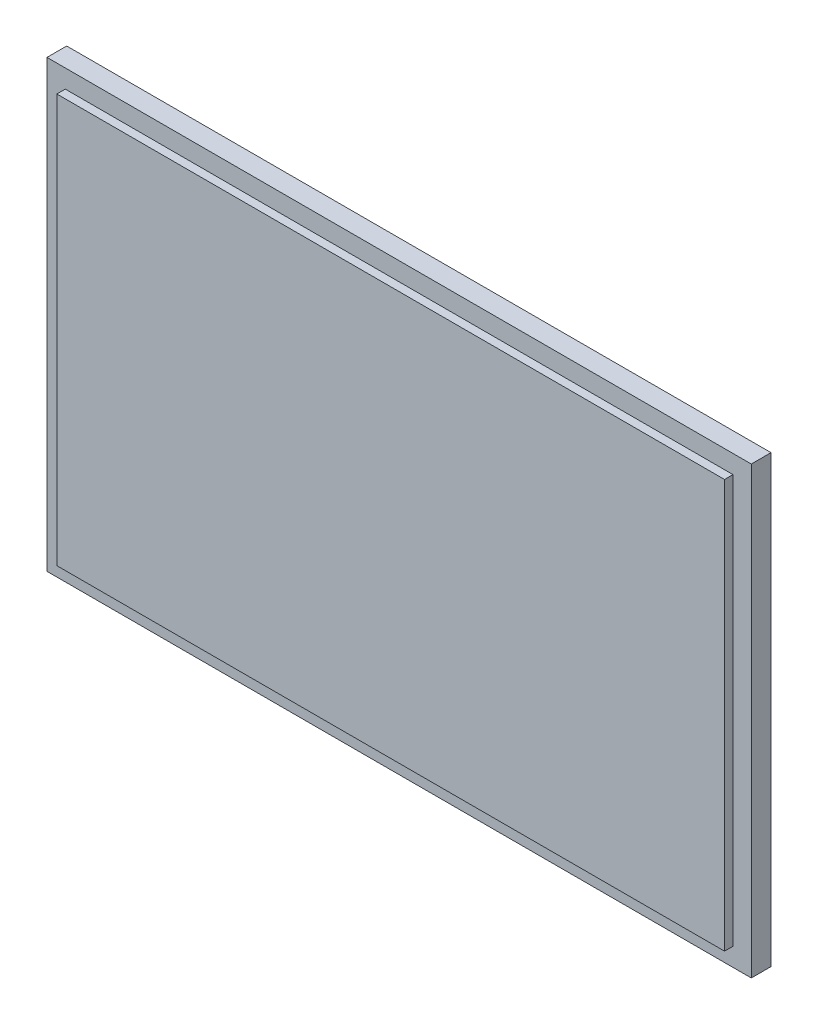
from build123d import *

# Parameters (mm, degrees)
ESQUISSE1_W             = 250
ESQUISSE1_H             = 158
BOSS_EXTRU_1_DEPTH      = 10
ESQUISSE3_W             = 250
ESQUISSE3_H             = 6.5
ENL_V_MAT_EXTRU_1_DEPTH = 3
ESQUISSE4_W             = 250
ESQUISSE4_H             = 6.5
ENL_V_MAT_EXTRU_2_DEPTH = 3
ESQUISSE5_W             = 6.5
ESQUISSE5_H             = 145
ENL_V_MAT_EXTRU_3_DEPTH = 3


with BuildPart() as part:
    # Esquisse1 → Boss.-Extru.1 (new body)
    with BuildSketch(Plane.XY):
        with Locations((26.259234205, -12.001743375)):
            Rectangle(ESQUISSE1_W, ESQUISSE1_H)
    extrude(amount=BOSS_EXTRU_1_DEPTH)

    # Esquisse3 → Enl_v. mat.-Extru.1 (cut)
    with BuildSketch(Plane.XY.offset(10)):
        with Locations((26.259234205, 63.748256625)):
            Rectangle(ESQUISSE3_W, ESQUISSE3_H)
    extrude(amount=-ENL_V_MAT_EXTRU_1_DEPTH, mode=Mode.SUBTRACT)

    # Esquisse4 → Enl_v. mat.-Extru.2 (cut)
    with BuildSketch(Plane.XY.offset(10)):
        with Locations((26.259234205, -87.751743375)):
            Rectangle(ESQUISSE4_W, ESQUISSE4_H)
    extrude(amount=-ENL_V_MAT_EXTRU_2_DEPTH, mode=Mode.SUBTRACT)

    # Esquisse5 → Enl_v. mat.-Extru.3 (cut)
    with BuildSketch(Plane.XY.offset(10)):
        with Locations((-95.490765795, -12.001743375)):
            Rectangle(ESQUISSE5_W, ESQUISSE5_H)
        with Locations((148.009234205, -12.001743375)):
            Rectangle(ESQUISSE5_W, ESQUISSE5_H)
    extrude(amount=-ENL_V_MAT_EXTRU_3_DEPTH, mode=Mode.SUBTRACT)


solid = part.part
